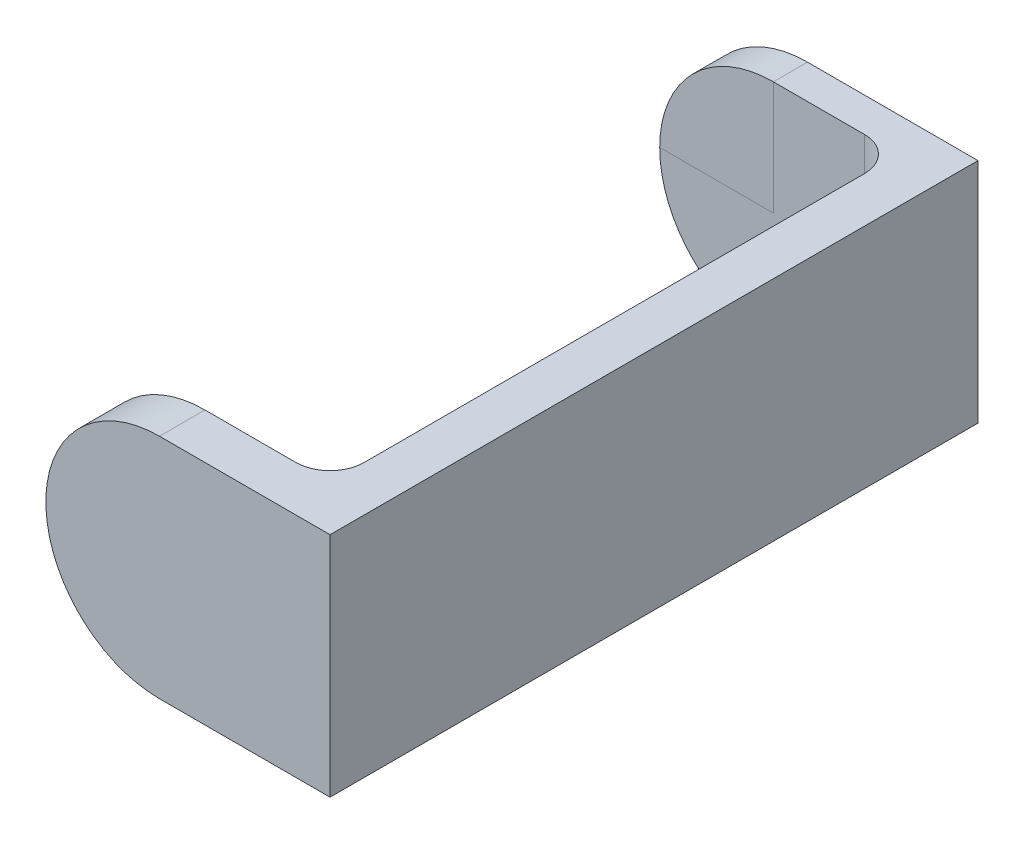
from build123d import *

# Parameters (mm, degrees)
EXTRUDE1_DEPTH = 80
EXTRUDE2_START = -60
EXTRUDE2_DEPTH = 60
EXTRUDE3_REACH = 1140.596
SKETCH4_W      = 80
SKETCH4_H      = 400
FILLET1_R      = 60


with BuildPart() as part:
    # Sketch2 → Extrude1 (new body)
    with BuildSketch(Plane.XY.offset(500)):
        with BuildLine():
            Line((0, -200), (300, -200))
            Line((300, -200), (300, 200))
            Line((300, 200), (0, 200))
            ThreePointArc((0, 200), (-200, 0), (0, -200))
        make_face()
    extrude(amount=EXTRUDE1_DEPTH)

    # Sketch4 → Extrude3 (add, up to next)
    with BuildSketch(Plane.XY.offset(-500), mode=Mode.PRIVATE) as extrude3_sk1:
        with Locations((260, 0)):
            Rectangle(SKETCH4_W, SKETCH4_H)
    extrude3_tool1 = extrude(extrude3_sk1.sketch, amount=EXTRUDE3_REACH, mode=Mode.PRIVATE) - part.part


with BuildPart() as body_2:
    # Sketch3 → Extrude2 (new body)
    with BuildSketch(Plane.XY.offset(-500).offset(EXTRUDE2_START)):
        with BuildLine():
            Line((300, 200), (0, 200))
            ThreePointArc((0, 200), (-200, 0), (0, -200))
            Line((0, -200), (300, -200))
            Line((300, -200), (300, 200))
        make_face()
    extrude(amount=EXTRUDE2_DEPTH)


with BuildPart() as part_1:
    add(part.part)

    add(body_2.part)  # Extrude3 merges body 2
    add(extrude3_tool1.solids().sort_by_distance((260, 0, -500))[0])

    # Fillet1
    fillet1_edges = [part_1.edges().sort_by_distance(p)[0] for p in [
        (220, 0, 500),
        (220, 0, -500),
    ]]
    fillet(fillet1_edges, radius=FILLET1_R)


solid = part_1.part
